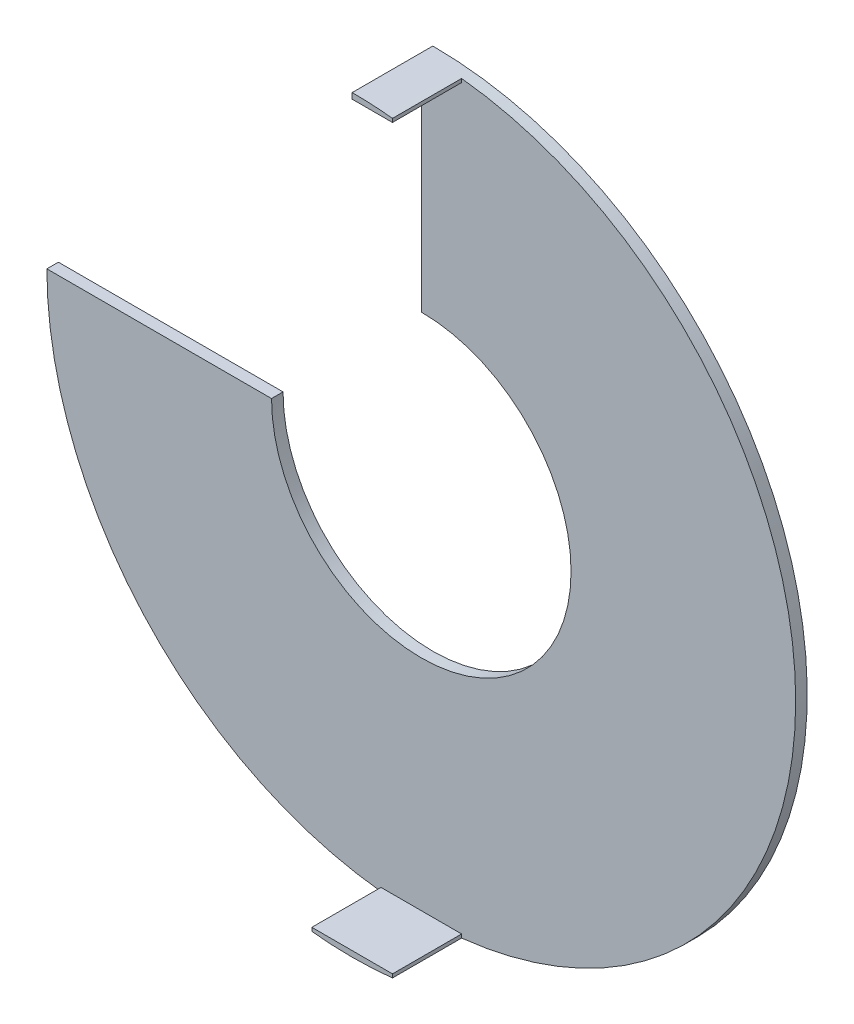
ISO-10303-21;
HEADER;
FILE_DESCRIPTION(('STEP AP214'),'2;1');
FILE_NAME('part.step','',(''),(''),'','','');
FILE_SCHEMA(('AUTOMOTIVE_DESIGN { 1 0 10303 214 1 1 1 1 }'));
ENDSEC;
DATA;
#1=APPLICATION_CONTEXT('core data for automotive mechanical design processes');
#2=APPLICATION_PROTOCOL_DEFINITION('international standard','automotive_design',2000,#1);
#3=PRODUCT_CONTEXT('',#1,'mechanical');
#4=PRODUCT('Part','Part','',(#3));
#5=PRODUCT_RELATED_PRODUCT_CATEGORY('part','',(#4));
#6=PRODUCT_DEFINITION_FORMATION('','',#4);
#7=PRODUCT_DEFINITION_CONTEXT('part definition',#1,'design');
#8=PRODUCT_DEFINITION('design','',#6,#7);
#9=PRODUCT_DEFINITION_SHAPE('','',#8);
#10=(LENGTH_UNIT() NAMED_UNIT(*) SI_UNIT(.MILLI.,.METRE.));
#11=(NAMED_UNIT(*) PLANE_ANGLE_UNIT() SI_UNIT($,.RADIAN.));
#12=(NAMED_UNIT(*) SI_UNIT($,.STERADIAN.) SOLID_ANGLE_UNIT());
#13=UNCERTAINTY_MEASURE_WITH_UNIT(LENGTH_MEASURE(1.E-05),#10,'distance_accuracy_value','');
#14=(GEOMETRIC_REPRESENTATION_CONTEXT(3) GLOBAL_UNCERTAINTY_ASSIGNED_CONTEXT((#13)) GLOBAL_UNIT_ASSIGNED_CONTEXT((#10,
#11,#12)) REPRESENTATION_CONTEXT('',''));
#15=CARTESIAN_POINT('',(0.,0.,0.));
#16=DIRECTION('',(0.,0.,1.));
#17=DIRECTION('',(1.,0.,0.));
#18=AXIS2_PLACEMENT_3D('',#15,#16,#17);
#19=CARTESIAN_POINT('',(-1.75,16.,3.5));
#20=DIRECTION('',(0.,1.,0.));
#21=DIRECTION('',(0.,0.,1.));
#22=AXIS2_PLACEMENT_3D('',#19,#20,#21);
#23=PLANE('',#22);
#24=DIRECTION('',(0.,0.,1.));
#25=VECTOR('',#24,1.);
#26=CARTESIAN_POINT('',(0.,16.,3.5));
#27=LINE('',#26,#25);
#28=CARTESIAN_POINT('',(0.,16.,0.5));
#29=VERTEX_POINT('',#28);
#30=CARTESIAN_POINT('',(0.,16.,3.5));
#31=VERTEX_POINT('',#30);
#32=EDGE_CURVE('E56',#29,#31,#27,.T.);
#33=ORIENTED_EDGE('',*,*,#32,.F.);
#34=DIRECTION('',(1.,0.,0.));
#35=VECTOR('',#34,1.);
#36=CARTESIAN_POINT('',(-1.75,16.,0.5));
#37=LINE('',#36,#35);
#38=CARTESIAN_POINT('',(1.75,16.,0.5));
#39=VERTEX_POINT('',#38);
#40=EDGE_CURVE('E140',#29,#39,#37,.T.);
#41=ORIENTED_EDGE('',*,*,#40,.T.);
#42=DIRECTION('',(0.,0.,-1.));
#43=VECTOR('',#42,1.);
#44=CARTESIAN_POINT('',(1.75,16.,3.5));
#45=LINE('',#44,#43);
#46=CARTESIAN_POINT('',(1.75,16.,3.5));
#47=VERTEX_POINT('',#46);
#48=EDGE_CURVE('E138',#47,#39,#45,.T.);
#49=ORIENTED_EDGE('',*,*,#48,.F.);
#50=DIRECTION('',(1.,0.,0.));
#51=VECTOR('',#50,1.);
#52=CARTESIAN_POINT('',(-1.75,16.,3.5));
#53=LINE('',#52,#51);
#54=EDGE_CURVE('E136',#31,#47,#53,.T.);
#55=ORIENTED_EDGE('',*,*,#54,.F.);
#56=EDGE_LOOP('',(#33,#41,#49,#55));
#57=FACE_BOUND('',#56,.T.);
#58=ADVANCED_FACE('F32',(#57),#23,.F.);
#59=CARTESIAN_POINT('',(0.,0.,3.5));
#60=DIRECTION('',(0.,0.,1.));
#61=DIRECTION('',(1.,0.,0.));
#62=AXIS2_PLACEMENT_3D('',#59,#60,#61);
#63=PLANE('',#62);
#64=CARTESIAN_POINT('',(0.,0.,3.5));
#65=DIRECTION('',(0.,0.,1.));
#66=DIRECTION('',(1.,0.,0.));
#67=AXIS2_PLACEMENT_3D('',#64,#65,#66);
#68=CIRCLE('',#67,16.25);
#69=CARTESIAN_POINT('',(1.75,16.1554944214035,3.5));
#70=VERTEX_POINT('',#69);
#71=CARTESIAN_POINT('',(0.,16.25,3.5));
#72=VERTEX_POINT('',#71);
#73=EDGE_CURVE('E125',#70,#72,#68,.T.);
#74=ORIENTED_EDGE('',*,*,#73,.T.);
#75=DIRECTION('',(0.,-1.,0.));
#76=VECTOR('',#75,1.);
#77=CARTESIAN_POINT('',(0.,0.,3.5));
#78=LINE('',#77,#76);
#79=EDGE_CURVE('E42',#72,#31,#78,.T.);
#80=ORIENTED_EDGE('',*,*,#79,.T.);
#81=ORIENTED_EDGE('',*,*,#54,.T.);
#82=DIRECTION('',(0.,1.,0.));
#83=VECTOR('',#82,1.);
#84=CARTESIAN_POINT('',(1.75,16.1554944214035,3.5));
#85=LINE('',#84,#83);
#86=EDGE_CURVE('E134',#47,#70,#85,.T.);
#87=ORIENTED_EDGE('',*,*,#86,.T.);
#88=EDGE_LOOP('',(#74,#80,#81,#87));
#89=FACE_BOUND('',#88,.T.);
#90=ADVANCED_FACE('F132',(#89),#63,.T.);
#91=CARTESIAN_POINT('',(0.,0.,0.5));
#92=DIRECTION('',(0.,0.,1.));
#93=DIRECTION('',(1.,0.,0.));
#94=AXIS2_PLACEMENT_3D('',#91,#92,#93);
#95=PLANE('',#94);
#96=DIRECTION('',(1.,0.,0.));
#97=VECTOR('',#96,1.);
#98=CARTESIAN_POINT('',(0.,0.,0.5));
#99=LINE('',#98,#97);
#100=CARTESIAN_POINT('',(-16.25,0.,0.5));
#101=VERTEX_POINT('',#100);
#102=CARTESIAN_POINT('',(-6.5,0.,0.5));
#103=VERTEX_POINT('',#102);
#104=EDGE_CURVE('E48',#101,#103,#99,.T.);
#105=ORIENTED_EDGE('',*,*,#104,.F.);
#106=CARTESIAN_POINT('',(0.,0.,0.5));
#107=DIRECTION('',(0.,0.,1.));
#108=DIRECTION('',(1.,0.,0.));
#109=AXIS2_PLACEMENT_3D('',#106,#107,#108);
#110=CIRCLE('',#109,16.25);
#111=CARTESIAN_POINT('',(-1.75000000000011,-16.1554944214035,0.5));
#112=VERTEX_POINT('',#111);
#113=EDGE_CURVE('E36',#101,#112,#110,.T.);
#114=ORIENTED_EDGE('',*,*,#113,.T.);
#115=DIRECTION('',(0.,-1.,0.));
#116=VECTOR('',#115,1.);
#117=CARTESIAN_POINT('',(-1.75000000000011,-16.1554944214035,0.5));
#118=LINE('',#117,#116);
#119=CARTESIAN_POINT('',(-1.75000000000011,-16.,0.5));
#120=VERTEX_POINT('',#119);
#121=EDGE_CURVE('E189',#120,#112,#118,.T.);
#122=ORIENTED_EDGE('',*,*,#121,.F.);
#123=DIRECTION('',(-1.,0.,0.));
#124=VECTOR('',#123,1.);
#125=CARTESIAN_POINT('',(1.74999999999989,-16.,0.5));
#126=LINE('',#125,#124);
#127=CARTESIAN_POINT('',(1.74999999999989,-16.,0.5));
#128=VERTEX_POINT('',#127);
#129=EDGE_CURVE('E185',#128,#120,#126,.T.);
#130=ORIENTED_EDGE('',*,*,#129,.F.);
#131=DIRECTION('',(0.,1.,0.));
#132=VECTOR('',#131,1.);
#133=CARTESIAN_POINT('',(1.74999999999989,-16.1554944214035,0.5));
#134=LINE('',#133,#132);
#135=CARTESIAN_POINT('',(1.74999999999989,-16.1554944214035,0.5));
#136=VERTEX_POINT('',#135);
#137=EDGE_CURVE('E183',#136,#128,#134,.T.);
#138=ORIENTED_EDGE('',*,*,#137,.F.);
#139=CARTESIAN_POINT('',(1.75,16.1554944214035,0.5));
#140=VERTEX_POINT('',#139);
#141=EDGE_CURVE('E153',#136,#140,#110,.T.);
#142=ORIENTED_EDGE('',*,*,#141,.T.);
#143=DIRECTION('',(0.,1.,0.));
#144=VECTOR('',#143,1.);
#145=CARTESIAN_POINT('',(1.75,16.1554944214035,0.5));
#146=LINE('',#145,#144);
#147=EDGE_CURVE('E160',#39,#140,#146,.T.);
#148=ORIENTED_EDGE('',*,*,#147,.F.);
#149=ORIENTED_EDGE('',*,*,#40,.F.);
#150=DIRECTION('',(0.,-1.,0.));
#151=VECTOR('',#150,1.);
#152=CARTESIAN_POINT('',(0.,0.,0.5));
#153=LINE('',#152,#151);
#154=CARTESIAN_POINT('',(0.,6.5,0.5));
#155=VERTEX_POINT('',#154);
#156=EDGE_CURVE('E220',#29,#155,#153,.T.);
#157=ORIENTED_EDGE('',*,*,#156,.T.);
#158=CARTESIAN_POINT('',(0.,0.,0.5));
#159=DIRECTION('',(0.,0.,1.));
#160=DIRECTION('',(1.,0.,0.));
#161=AXIS2_PLACEMENT_3D('',#158,#159,#160);
#162=CIRCLE('',#161,6.5);
#163=EDGE_CURVE('E150',#103,#155,#162,.T.);
#164=ORIENTED_EDGE('',*,*,#163,.F.);
#165=EDGE_LOOP('',(#105,#114,#122,#130,#138,#142,#148,#149,#157,#164));
#166=FACE_BOUND('',#165,.T.);
#167=ADVANCED_FACE('F174',(#166),#95,.T.);
#168=CARTESIAN_POINT('',(0.,0.,0.));
#169=DIRECTION('',(0.,0.,1.));
#170=DIRECTION('',(1.,0.,0.));
#171=AXIS2_PLACEMENT_3D('',#168,#169,#170);
#172=PLANE('',#171);
#173=CARTESIAN_POINT('',(0.,0.,0.));
#174=DIRECTION('',(0.,0.,1.));
#175=DIRECTION('',(1.,0.,0.));
#176=AXIS2_PLACEMENT_3D('',#173,#174,#175);
#177=CIRCLE('',#176,16.25);
#178=CARTESIAN_POINT('',(-16.25,0.,0.));
#179=VERTEX_POINT('',#178);
#180=CARTESIAN_POINT('',(0.,16.25,0.));
#181=VERTEX_POINT('',#180);
#182=EDGE_CURVE('E129',#179,#181,#177,.T.);
#183=ORIENTED_EDGE('',*,*,#182,.F.);
#184=DIRECTION('',(1.,0.,0.));
#185=VECTOR('',#184,1.);
#186=CARTESIAN_POINT('',(0.,0.,0.));
#187=LINE('',#186,#185);
#188=CARTESIAN_POINT('',(-6.5,0.,0.));
#189=VERTEX_POINT('',#188);
#190=EDGE_CURVE('E214',#179,#189,#187,.T.);
#191=ORIENTED_EDGE('',*,*,#190,.T.);
#192=CARTESIAN_POINT('',(0.,0.,0.));
#193=DIRECTION('',(0.,0.,1.));
#194=DIRECTION('',(1.,0.,0.));
#195=AXIS2_PLACEMENT_3D('',#192,#193,#194);
#196=CIRCLE('',#195,6.5);
#197=CARTESIAN_POINT('',(0.,6.5,0.));
#198=VERTEX_POINT('',#197);
#199=EDGE_CURVE('E147',#189,#198,#196,.T.);
#200=ORIENTED_EDGE('',*,*,#199,.T.);
#201=DIRECTION('',(0.,-1.,0.));
#202=VECTOR('',#201,1.);
#203=CARTESIAN_POINT('',(0.,0.,0.));
#204=LINE('',#203,#202);
#205=EDGE_CURVE('E130',#181,#198,#204,.T.);
#206=ORIENTED_EDGE('',*,*,#205,.F.);
#207=EDGE_LOOP('',(#183,#191,#200,#206));
#208=FACE_BOUND('',#207,.T.);
#209=ADVANCED_FACE('F228',(#208),#172,.F.);
#210=CARTESIAN_POINT('',(0.,0.,0.5));
#211=DIRECTION('',(0.,0.,-1.));
#212=DIRECTION('',(-1.,0.,0.));
#213=AXIS2_PLACEMENT_3D('',#210,#211,#212);
#214=CYLINDRICAL_SURFACE('',#213,16.25);
#215=ORIENTED_EDGE('',*,*,#113,.F.);
#216=DIRECTION('',(0.,0.,-1.));
#217=VECTOR('',#216,1.);
#218=CARTESIAN_POINT('',(-16.25,0.,0.5));
#219=LINE('',#218,#217);
#220=EDGE_CURVE('E211',#101,#179,#219,.T.);
#221=ORIENTED_EDGE('',*,*,#220,.T.);
#222=ORIENTED_EDGE('',*,*,#182,.T.);
#223=DIRECTION('',(0.,0.,-1.));
#224=VECTOR('',#223,1.);
#225=CARTESIAN_POINT('',(0.,16.25,0.5));
#226=LINE('',#225,#224);
#227=EDGE_CURVE('E115',#72,#181,#226,.T.);
#228=ORIENTED_EDGE('',*,*,#227,.F.);
#229=ORIENTED_EDGE('',*,*,#73,.F.);
#230=DIRECTION('',(0.,0.,-1.));
#231=VECTOR('',#230,1.);
#232=CARTESIAN_POINT('',(1.75,16.1554944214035,3.5));
#233=LINE('',#232,#231);
#234=EDGE_CURVE('E146',#70,#140,#233,.T.);
#235=ORIENTED_EDGE('',*,*,#234,.T.);
#236=ORIENTED_EDGE('',*,*,#141,.F.);
#237=DIRECTION('',(0.,0.,-1.));
#238=VECTOR('',#237,1.);
#239=CARTESIAN_POINT('',(1.74999999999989,-16.1554944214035,3.5));
#240=LINE('',#239,#238);
#241=CARTESIAN_POINT('',(1.74999999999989,-16.1554944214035,3.5));
#242=VERTEX_POINT('',#241);
#243=EDGE_CURVE('E180',#242,#136,#240,.T.);
#244=ORIENTED_EDGE('',*,*,#243,.F.);
#245=CARTESIAN_POINT('',(0.,0.,3.5));
#246=DIRECTION('',(0.,0.,1.));
#247=DIRECTION('',(-1.,0.,0.));
#248=AXIS2_PLACEMENT_3D('',#245,#246,#247);
#249=CIRCLE('',#248,16.25);
#250=CARTESIAN_POINT('',(-1.75000000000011,-16.1554944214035,3.5));
#251=VERTEX_POINT('',#250);
#252=EDGE_CURVE('E203',#251,#242,#249,.T.);
#253=ORIENTED_EDGE('',*,*,#252,.F.);
#254=DIRECTION('',(0.,0.,-1.));
#255=VECTOR('',#254,1.);
#256=CARTESIAN_POINT('',(-1.75000000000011,-16.1554944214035,3.5));
#257=LINE('',#256,#255);
#258=EDGE_CURVE('E163',#251,#112,#257,.T.);
#259=ORIENTED_EDGE('',*,*,#258,.T.);
#260=EDGE_LOOP('',(#215,#221,#222,#228,#229,#235,#236,#244,#253,#259));
#261=FACE_BOUND('',#260,.T.);
#262=ADVANCED_FACE('F34',(#261),#214,.T.);
#263=CARTESIAN_POINT('',(0.,0.,0.5));
#264=DIRECTION('',(0.,0.,-1.));
#265=DIRECTION('',(-1.,0.,0.));
#266=AXIS2_PLACEMENT_3D('',#263,#264,#265);
#267=CYLINDRICAL_SURFACE('',#266,6.5);
#268=DIRECTION('',(0.,0.,-1.));
#269=VECTOR('',#268,1.);
#270=CARTESIAN_POINT('',(-6.5,0.,0.5));
#271=LINE('',#270,#269);
#272=EDGE_CURVE('E11',#103,#189,#271,.T.);
#273=ORIENTED_EDGE('',*,*,#272,.F.);
#274=ORIENTED_EDGE('',*,*,#163,.T.);
#275=DIRECTION('',(0.,0.,-1.));
#276=VECTOR('',#275,1.);
#277=CARTESIAN_POINT('',(0.,6.5,0.5));
#278=LINE('',#277,#276);
#279=EDGE_CURVE('E217',#155,#198,#278,.T.);
#280=ORIENTED_EDGE('',*,*,#279,.T.);
#281=ORIENTED_EDGE('',*,*,#199,.F.);
#282=EDGE_LOOP('',(#273,#274,#280,#281));
#283=FACE_BOUND('',#282,.T.);
#284=ADVANCED_FACE('F226',(#283),#267,.F.);
#285=CARTESIAN_POINT('',(1.75,16.1554944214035,3.5));
#286=DIRECTION('',(-1.,0.,0.));
#287=DIRECTION('',(0.,-1.,0.));
#288=AXIS2_PLACEMENT_3D('',#285,#286,#287);
#289=PLANE('',#288);
#290=ORIENTED_EDGE('',*,*,#147,.T.);
#291=ORIENTED_EDGE('',*,*,#234,.F.);
#292=ORIENTED_EDGE('',*,*,#86,.F.);
#293=ORIENTED_EDGE('',*,*,#48,.T.);
#294=EDGE_LOOP('',(#290,#291,#292,#293));
#295=FACE_BOUND('',#294,.T.);
#296=ADVANCED_FACE('F177',(#295),#289,.F.);
#297=CARTESIAN_POINT('',(-1.75000000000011,-16.1554944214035,3.5));
#298=DIRECTION('',(1.,0.,0.));
#299=DIRECTION('',(0.,1.,0.));
#300=AXIS2_PLACEMENT_3D('',#297,#298,#299);
#301=PLANE('',#300);
#302=ORIENTED_EDGE('',*,*,#121,.T.);
#303=ORIENTED_EDGE('',*,*,#258,.F.);
#304=DIRECTION('',(0.,-1.,0.));
#305=VECTOR('',#304,1.);
#306=CARTESIAN_POINT('',(-1.75000000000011,-16.1554944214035,3.5));
#307=LINE('',#306,#305);
#308=CARTESIAN_POINT('',(-1.75000000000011,-16.,3.5));
#309=VERTEX_POINT('',#308);
#310=EDGE_CURVE('E205',#309,#251,#307,.T.);
#311=ORIENTED_EDGE('',*,*,#310,.F.);
#312=DIRECTION('',(0.,0.,-1.));
#313=VECTOR('',#312,1.);
#314=CARTESIAN_POINT('',(-1.75000000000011,-16.,3.5));
#315=LINE('',#314,#313);
#316=EDGE_CURVE('E195',#309,#120,#315,.T.);
#317=ORIENTED_EDGE('',*,*,#316,.T.);
#318=EDGE_LOOP('',(#302,#303,#311,#317));
#319=FACE_BOUND('',#318,.T.);
#320=ADVANCED_FACE('F237',(#319),#301,.F.);
#321=CARTESIAN_POINT('',(1.74999999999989,-16.1554944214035,3.5));
#322=DIRECTION('',(-1.,0.,0.));
#323=DIRECTION('',(0.,-1.,0.));
#324=AXIS2_PLACEMENT_3D('',#321,#322,#323);
#325=PLANE('',#324);
#326=ORIENTED_EDGE('',*,*,#137,.T.);
#327=DIRECTION('',(0.,0.,-1.));
#328=VECTOR('',#327,1.);
#329=CARTESIAN_POINT('',(1.74999999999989,-16.,3.5));
#330=LINE('',#329,#328);
#331=CARTESIAN_POINT('',(1.74999999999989,-16.,3.5));
#332=VERTEX_POINT('',#331);
#333=EDGE_CURVE('E193',#332,#128,#330,.T.);
#334=ORIENTED_EDGE('',*,*,#333,.F.);
#335=DIRECTION('',(0.,1.,0.));
#336=VECTOR('',#335,1.);
#337=CARTESIAN_POINT('',(1.74999999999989,-16.1554944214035,3.5));
#338=LINE('',#337,#336);
#339=EDGE_CURVE('E192',#242,#332,#338,.T.);
#340=ORIENTED_EDGE('',*,*,#339,.F.);
#341=ORIENTED_EDGE('',*,*,#243,.T.);
#342=EDGE_LOOP('',(#326,#334,#340,#341));
#343=FACE_BOUND('',#342,.T.);
#344=ADVANCED_FACE('F191',(#343),#325,.F.);
#345=CARTESIAN_POINT('',(1.74999999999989,-16.,3.5));
#346=DIRECTION('',(0.,-1.,0.));
#347=DIRECTION('',(1.,0.,0.));
#348=AXIS2_PLACEMENT_3D('',#345,#346,#347);
#349=PLANE('',#348);
#350=ORIENTED_EDGE('',*,*,#129,.T.);
#351=ORIENTED_EDGE('',*,*,#316,.F.);
#352=DIRECTION('',(-1.,0.,0.));
#353=VECTOR('',#352,1.);
#354=CARTESIAN_POINT('',(1.74999999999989,-16.,3.5));
#355=LINE('',#354,#353);
#356=EDGE_CURVE('E200',#332,#309,#355,.T.);
#357=ORIENTED_EDGE('',*,*,#356,.F.);
#358=ORIENTED_EDGE('',*,*,#333,.T.);
#359=EDGE_LOOP('',(#350,#351,#357,#358));
#360=FACE_BOUND('',#359,.T.);
#361=ADVANCED_FACE('F234',(#360),#349,.F.);
#362=CARTESIAN_POINT('',(0.,0.,3.5));
#363=DIRECTION('',(0.,0.,1.));
#364=DIRECTION('',(-1.,0.,0.));
#365=AXIS2_PLACEMENT_3D('',#362,#363,#364);
#366=PLANE('',#365);
#367=ORIENTED_EDGE('',*,*,#310,.T.);
#368=ORIENTED_EDGE('',*,*,#252,.T.);
#369=ORIENTED_EDGE('',*,*,#339,.T.);
#370=ORIENTED_EDGE('',*,*,#356,.T.);
#371=EDGE_LOOP('',(#367,#368,#369,#370));
#372=FACE_BOUND('',#371,.T.);
#373=ADVANCED_FACE('F239',(#372),#366,.T.);
#374=CARTESIAN_POINT('',(0.,17.1255389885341,11.7269672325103));
#375=DIRECTION('',(-1.,0.,0.));
#376=DIRECTION('',(0.,0.,1.));
#377=AXIS2_PLACEMENT_3D('',#374,#375,#376);
#378=PLANE('',#377);
#379=ORIENTED_EDGE('',*,*,#156,.F.);
#380=ORIENTED_EDGE('',*,*,#32,.T.);
#381=ORIENTED_EDGE('',*,*,#79,.F.);
#382=ORIENTED_EDGE('',*,*,#227,.T.);
#383=ORIENTED_EDGE('',*,*,#205,.T.);
#384=ORIENTED_EDGE('',*,*,#279,.F.);
#385=EDGE_LOOP('',(#379,#380,#381,#382,#383,#384));
#386=FACE_BOUND('',#385,.T.);
#387=ADVANCED_FACE('F114',(#386),#378,.T.);
#388=CARTESIAN_POINT('',(-16.250025,0.,11.7269672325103));
#389=DIRECTION('',(0.,-1.,0.));
#390=DIRECTION('',(0.,0.,-1.));
#391=AXIS2_PLACEMENT_3D('',#388,#389,#390);
#392=PLANE('',#391);
#393=ORIENTED_EDGE('',*,*,#104,.T.);
#394=ORIENTED_EDGE('',*,*,#272,.T.);
#395=ORIENTED_EDGE('',*,*,#190,.F.);
#396=ORIENTED_EDGE('',*,*,#220,.F.);
#397=EDGE_LOOP('',(#393,#394,#395,#396));
#398=FACE_BOUND('',#397,.T.);
#399=ADVANCED_FACE('F229',(#398),#392,.F.);
#400=CLOSED_SHELL('',(#58,#90,#167,#209,#262,#284,#296,#320,#344,#361,#373,#387,#399));
#401=MANIFOLD_SOLID_BREP('B2',#400);
#402=ADVANCED_BREP_SHAPE_REPRESENTATION('',(#18,#401),#14);
#403=SHAPE_DEFINITION_REPRESENTATION(#9,#402);
ENDSEC;
END-ISO-10303-21;
